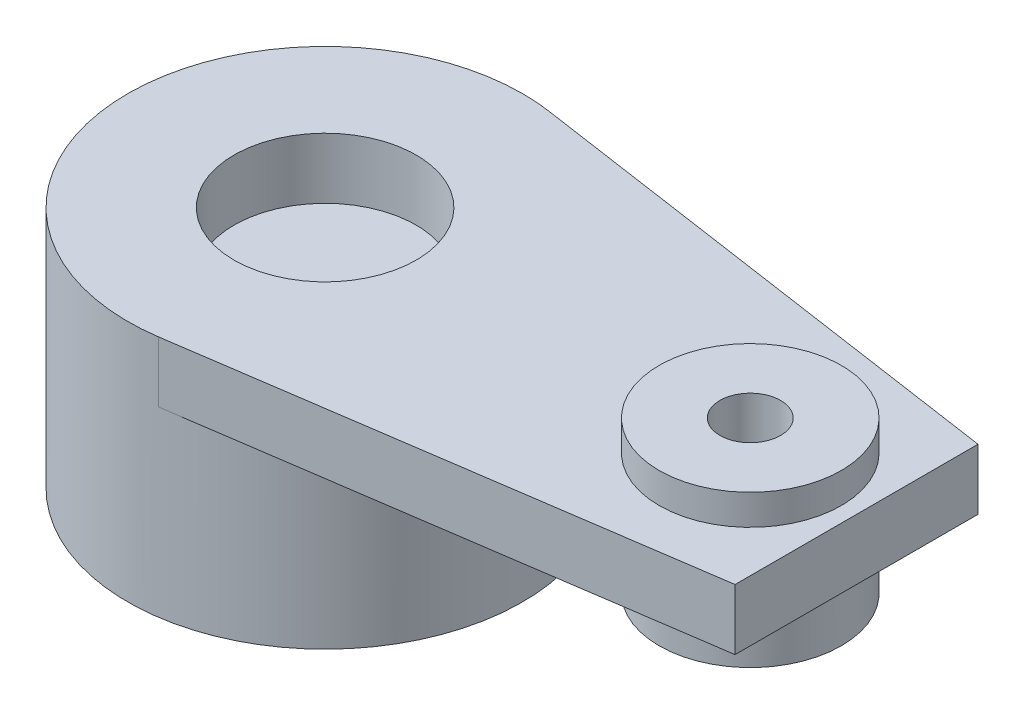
from build123d import *

# Parameters (mm, degrees)
BOSS_EXTRUDE1_DEPTH = 2.54
SKETCH2_R           = 3.81
SKETCH2_R_2         = 1.27
CUT_EXTRUDE1_DEPTH  = 24.844228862
BOSS_EXTRUDE2_START = 7.62
SKETCH3_R           = 8.255
BOSS_EXTRUDE2_DEPTH = 7.62
SKETCH4_R           = 3.81
SKETCH4_R_2         = 1.27
BOSS_EXTRUDE3_DEPTH = 2.54
BOSS_EXTRUDE4_START = 1.27
SKETCH5_R           = 3.81
SKETCH5_R_2         = 1.27
BOSS_EXTRUDE4_DEPTH = 1.27
SKETCH6_R           = 2.54
CUT_EXTRUDE2_DEPTH  = 2.54


with BuildPart() as part:
    # Sketch1 → Boss-Extrude1 (new body)
    with BuildSketch(Plane(origin=(0, 0, 0), x_dir=(1, 0, 0), z_dir=(0, 1, 0))):
        with BuildLine():
            ThreePointArc((6.506813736, 5.08), (4.150795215, 7.135539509), (1.19930479, 8.167416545))
            ThreePointArc((1.19930479, 8.167416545), (-8.255, 0), (1.19930479, -8.167416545))
            ThreePointArc((1.19930479, -8.167416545), (4.150795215, -7.135539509), (6.506813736, -5.08))
            Line((6.506813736, -5.08), (0, -5.08))
            Line((0, -5.08), (0, 5.08))
            Line((0, 5.08), (6.506813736, 5.08))
        make_face()
        with BuildLine():
            ThreePointArc((8.255, 0), (7.805727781, 2.686194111), (6.506813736, 5.08))
            Line((6.506813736, 5.08), (0, 5.08))
            Line((0, 5.08), (0, -5.08))
            Line((0, -5.08), (6.506813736, -5.08))
            ThreePointArc((6.506813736, -5.08), (7.805727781, -2.686194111), (8.255, 0))
        make_face()
        with BuildLine():
            ThreePointArc((6.506813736, 5.08), (4.150795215, 7.135539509), (1.19930479, 8.167416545))
            ThreePointArc((1.19930479, 8.167416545), (-8.255, 0), (1.19930479, -8.167416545))
            ThreePointArc((1.19930479, -8.167416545), (4.150795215, -7.135539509), (6.506813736, -5.08))
            Line((6.506813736, -5.08), (0, -5.08))
            Line((0, -5.08), (0, 5.08))
            Line((0, 5.08), (6.506813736, 5.08))
        make_face()
        with BuildLine():
            ThreePointArc((8.255, 0), (7.805727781, 2.686194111), (6.506813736, 5.08))
            Line((6.506813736, 5.08), (0, 5.08))
            Line((0, 5.08), (0, -5.08))
            Line((0, -5.08), (6.506813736, -5.08))
            ThreePointArc((6.506813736, -5.08), (7.805727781, -2.686194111), (8.255, 0))
        make_face()
        with BuildLine():
            Line((22.225, -5.08), (22.225, 5.08))
            Line((22.225, 5.08), (6.506813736, 5.08))
            ThreePointArc((6.506813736, 5.08), (7.805727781, 2.686194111), (8.255, 0))
            ThreePointArc((8.255, 0), (7.805727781, -2.686194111), (6.506813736, -5.08))
            Line((6.506813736, -5.08), (22.225, -5.08))
        make_face()
        with BuildLine():
            Line((1.19930479, -8.167416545), (22.225, -5.08))
            Line((22.225, -5.08), (6.506813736, -5.08))
            ThreePointArc((6.506813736, -5.08), (4.150795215, -7.135539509), (1.19930479, -8.167416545))
        make_face()
        with BuildLine():
            Line((6.506813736, 5.08), (22.225, 5.08))
            Line((22.225, 5.08), (1.19930479, 8.167416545))
            ThreePointArc((1.19930479, 8.167416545), (4.150795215, 7.135539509), (6.506813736, 5.08))
        make_face()
    extrude(amount=BOSS_EXTRUDE1_DEPTH)

    # Sketch2 → Cut-Extrude1 (cut, through all)
    with BuildSketch(Plane(origin=(0, 2.54, 0), x_dir=(1, 0, 0), z_dir=(0, 1, 0))):
        with Locations(Location((0, 0, 0), (0, 0, 270))):
            Circle(SKETCH2_R)
        with Locations(Location((17.78, 0, 0), (0, 0, 270))):
            Circle(SKETCH2_R_2)
    extrude(amount=-CUT_EXTRUDE1_DEPTH, mode=Mode.SUBTRACT)

    # Sketch3 → Boss-Extrude2 (add)
    with BuildSketch(Plane.XZ.offset(BOSS_EXTRUDE2_START)):
        with Locations(Location((0, 0, 0), (0, 0, 270))):
            Circle(SKETCH3_R)
    extrude(amount=-BOSS_EXTRUDE2_DEPTH)

    # Sketch4 → Boss-Extrude3 (add)
    with BuildSketch(Plane.XZ):
        with Locations(Location((17.78, 0, 0), (0, 0, 90))):
            Circle(SKETCH4_R)
        with Locations(Location((17.78, 0, 0), (0, 0, 90))):
            Circle(SKETCH4_R_2, mode=Mode.SUBTRACT)
    extrude(amount=BOSS_EXTRUDE3_DEPTH)

    # Sketch5 → Boss-Extrude4 (add)
    with BuildSketch(Plane(origin=(0, 2.54, 0), x_dir=(1, 0, 0), z_dir=(0, 1, 0)).offset(BOSS_EXTRUDE4_START)):
        with Locations(Location((17.78, 0, 0), (0, 0, 270))):
            Circle(SKETCH5_R)
        with Locations(Location((17.78, 0, 0), (0, 0, 270))):
            Circle(SKETCH5_R_2, mode=Mode.SUBTRACT)
    extrude(amount=-BOSS_EXTRUDE4_DEPTH)

    # Sketch6 → Cut-Extrude2 (cut)
    with BuildSketch(Plane.XZ.offset(7.62)):
        with Locations(Location((0, 0, 0), (0, 0, 270))):
            Circle(SKETCH6_R)
    extrude(amount=-CUT_EXTRUDE2_DEPTH, mode=Mode.SUBTRACT)


solid = part.part
